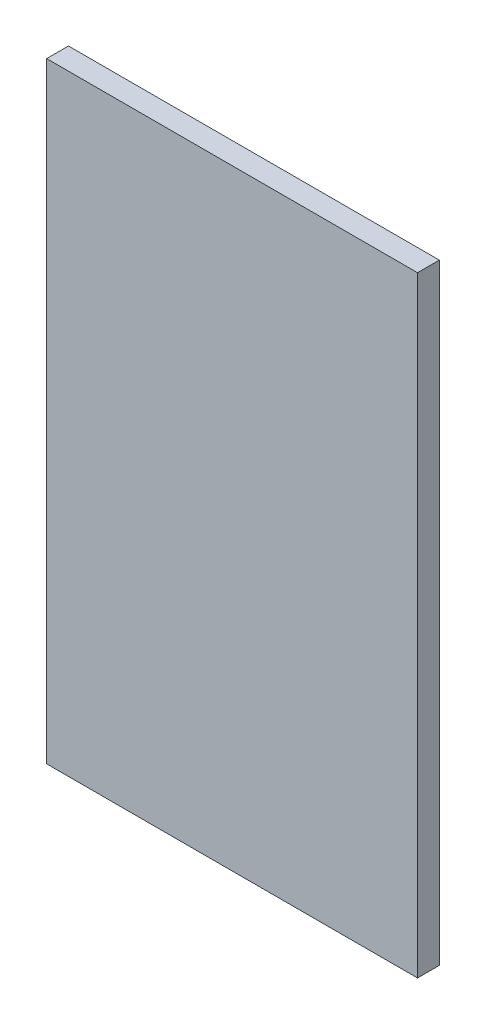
from build123d import *

# Parameters (mm, degrees)
ESQUISSE1_W        = 85
ESQUISSE1_H        = 140
BOSS_EXTRU_1_DEPTH = 5


with BuildPart() as part:
    # Esquisse1 → Boss.-Extru.1 (new body)
    with BuildSketch(Plane.XY):
        with Locations((42.5, 70)):
            Rectangle(ESQUISSE1_W, ESQUISSE1_H)
    extrude(amount=BOSS_EXTRU_1_DEPTH)


solid = part.part
